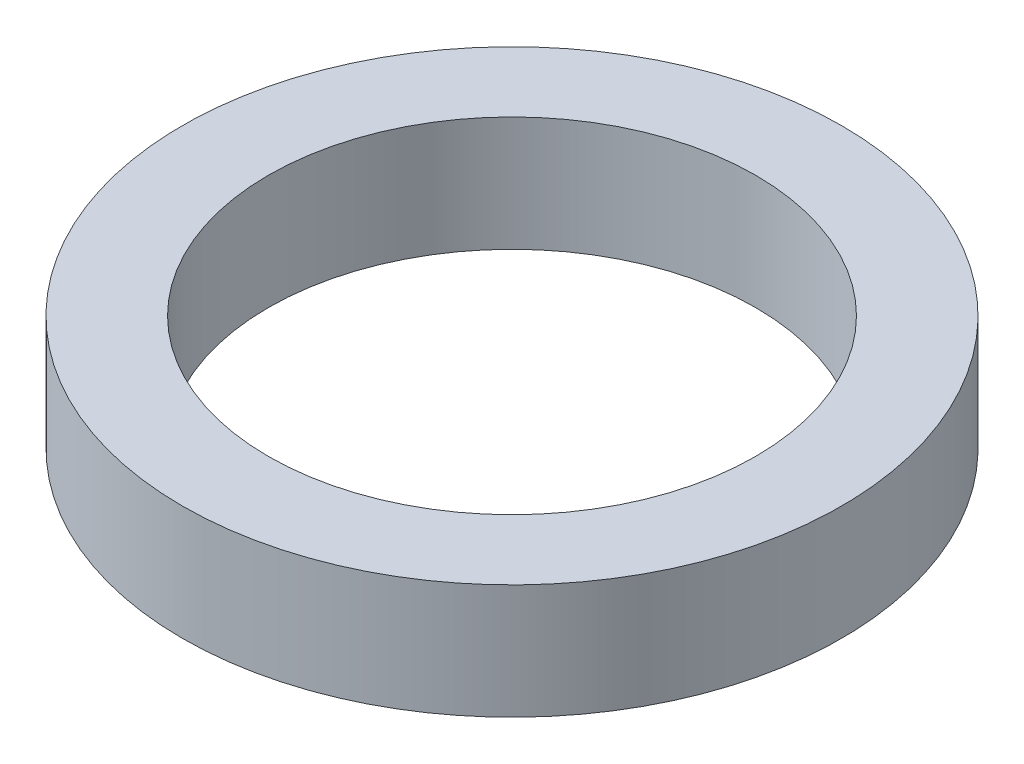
ISO-10303-21;
HEADER;
FILE_DESCRIPTION(('STEP AP214'),'2;1');
FILE_NAME('part.step','',(''),(''),'','','');
FILE_SCHEMA(('AUTOMOTIVE_DESIGN { 1 0 10303 214 1 1 1 1 }'));
ENDSEC;
DATA;
#1=APPLICATION_CONTEXT('core data for automotive mechanical design processes');
#2=APPLICATION_PROTOCOL_DEFINITION('international standard','automotive_design',2000,#1);
#3=PRODUCT_CONTEXT('',#1,'mechanical');
#4=PRODUCT('Part','Part','',(#3));
#5=PRODUCT_RELATED_PRODUCT_CATEGORY('part','',(#4));
#6=PRODUCT_DEFINITION_FORMATION('','',#4);
#7=PRODUCT_DEFINITION_CONTEXT('part definition',#1,'design');
#8=PRODUCT_DEFINITION('design','',#6,#7);
#9=PRODUCT_DEFINITION_SHAPE('','',#8);
#10=(LENGTH_UNIT() NAMED_UNIT(*) SI_UNIT(.MILLI.,.METRE.));
#11=(NAMED_UNIT(*) PLANE_ANGLE_UNIT() SI_UNIT($,.RADIAN.));
#12=(NAMED_UNIT(*) SI_UNIT($,.STERADIAN.) SOLID_ANGLE_UNIT());
#13=UNCERTAINTY_MEASURE_WITH_UNIT(LENGTH_MEASURE(1.E-05),#10,'distance_accuracy_value','');
#14=(GEOMETRIC_REPRESENTATION_CONTEXT(3) GLOBAL_UNCERTAINTY_ASSIGNED_CONTEXT((#13)) GLOBAL_UNIT_ASSIGNED_CONTEXT((#10,
#11,#12)) REPRESENTATION_CONTEXT('',''));
#15=CARTESIAN_POINT('',(0.,0.,0.));
#16=DIRECTION('',(0.,0.,1.));
#17=DIRECTION('',(1.,0.,0.));
#18=AXIS2_PLACEMENT_3D('',#15,#16,#17);
#19=CARTESIAN_POINT('',(0.,2.,0.));
#20=DIRECTION('',(0.,1.,0.));
#21=DIRECTION('',(0.,0.,1.));
#22=AXIS2_PLACEMENT_3D('',#19,#20,#21);
#23=PLANE('',#22);
#24=CARTESIAN_POINT('',(0.,2.,0.));
#25=DIRECTION('',(0.,1.,0.));
#26=DIRECTION('',(0.,0.,1.));
#27=AXIS2_PLACEMENT_3D('',#24,#25,#26);
#28=CIRCLE('',#27,5.75);
#29=CARTESIAN_POINT('',(0.,2.,5.75));
#30=VERTEX_POINT('',#29);
#31=EDGE_CURVE('E10',#30,#30,#28,.T.);
#32=ORIENTED_EDGE('',*,*,#31,.T.);
#33=EDGE_LOOP('',(#32));
#34=FACE_BOUND('',#33,.T.);
#35=CARTESIAN_POINT('',(0.,2.,0.));
#36=DIRECTION('',(0.,1.,0.));
#37=DIRECTION('',(0.,0.,1.));
#38=AXIS2_PLACEMENT_3D('',#35,#36,#37);
#39=CIRCLE('',#38,4.25);
#40=CARTESIAN_POINT('',(0.,2.,4.25));
#41=VERTEX_POINT('',#40);
#42=EDGE_CURVE('E43',#41,#41,#39,.T.);
#43=ORIENTED_EDGE('',*,*,#42,.F.);
#44=EDGE_LOOP('',(#43));
#45=FACE_BOUND('',#44,.T.);
#46=ADVANCED_FACE('F32',(#34,#45),#23,.T.);
#47=CARTESIAN_POINT('',(0.,0.,0.));
#48=DIRECTION('',(0.,1.,0.));
#49=DIRECTION('',(0.,0.,1.));
#50=AXIS2_PLACEMENT_3D('',#47,#48,#49);
#51=PLANE('',#50);
#52=CARTESIAN_POINT('',(0.,0.,0.));
#53=DIRECTION('',(0.,1.,0.));
#54=DIRECTION('',(0.,0.,1.));
#55=AXIS2_PLACEMENT_3D('',#52,#53,#54);
#56=CIRCLE('',#55,5.75);
#57=CARTESIAN_POINT('',(0.,0.,5.75));
#58=VERTEX_POINT('',#57);
#59=EDGE_CURVE('E36',#58,#58,#56,.T.);
#60=ORIENTED_EDGE('',*,*,#59,.F.);
#61=EDGE_LOOP('',(#60));
#62=FACE_BOUND('',#61,.T.);
#63=CARTESIAN_POINT('',(0.,0.,0.));
#64=DIRECTION('',(0.,1.,0.));
#65=DIRECTION('',(0.,0.,1.));
#66=AXIS2_PLACEMENT_3D('',#63,#64,#65);
#67=CIRCLE('',#66,4.25);
#68=CARTESIAN_POINT('',(0.,0.,4.25));
#69=VERTEX_POINT('',#68);
#70=EDGE_CURVE('E45',#69,#69,#67,.T.);
#71=ORIENTED_EDGE('',*,*,#70,.T.);
#72=EDGE_LOOP('',(#71));
#73=FACE_BOUND('',#72,.T.);
#74=ADVANCED_FACE('F55',(#62,#73),#51,.F.);
#75=CARTESIAN_POINT('',(0.,2.,0.));
#76=DIRECTION('',(0.,-1.,0.));
#77=DIRECTION('',(0.,0.,-1.));
#78=AXIS2_PLACEMENT_3D('',#75,#76,#77);
#79=CYLINDRICAL_SURFACE('',#78,5.75);
#80=ORIENTED_EDGE('',*,*,#31,.F.);
#81=EDGE_LOOP('',(#80));
#82=FACE_BOUND('',#81,.T.);
#83=ORIENTED_EDGE('',*,*,#59,.T.);
#84=EDGE_LOOP('',(#83));
#85=FACE_BOUND('',#84,.T.);
#86=ADVANCED_FACE('F34',(#82,#85),#79,.T.);
#87=CARTESIAN_POINT('',(0.,2.,0.));
#88=DIRECTION('',(0.,-1.,0.));
#89=DIRECTION('',(0.,0.,-1.));
#90=AXIS2_PLACEMENT_3D('',#87,#88,#89);
#91=CYLINDRICAL_SURFACE('',#90,4.25);
#92=ORIENTED_EDGE('',*,*,#42,.T.);
#93=EDGE_LOOP('',(#92));
#94=FACE_BOUND('',#93,.T.);
#95=ORIENTED_EDGE('',*,*,#70,.F.);
#96=EDGE_LOOP('',(#95));
#97=FACE_BOUND('',#96,.T.);
#98=ADVANCED_FACE('F51',(#94,#97),#91,.F.);
#99=CLOSED_SHELL('',(#46,#74,#86,#98));
#100=MANIFOLD_SOLID_BREP('B2',#99);
#101=ADVANCED_BREP_SHAPE_REPRESENTATION('',(#18,#100),#14);
#102=SHAPE_DEFINITION_REPRESENTATION(#9,#101);
ENDSEC;
END-ISO-10303-21;
